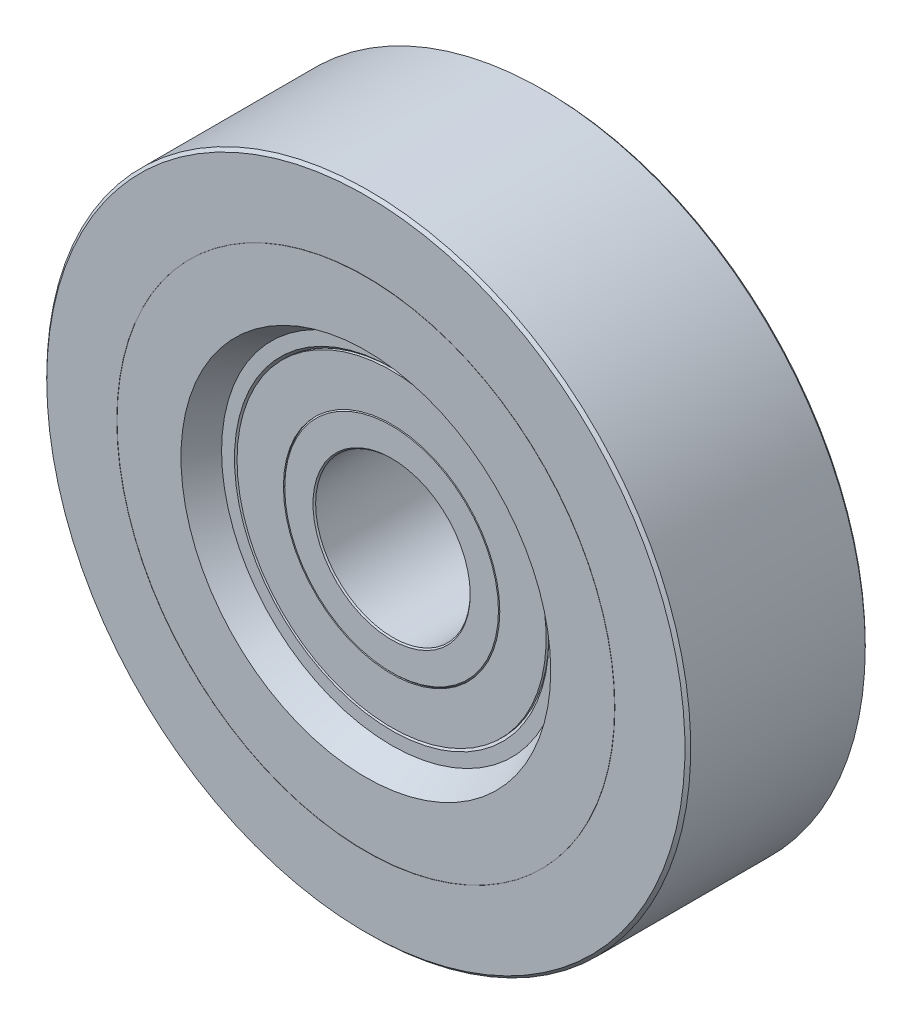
ISO-10303-21;
HEADER;
FILE_DESCRIPTION(('STEP AP214'),'2;1');
FILE_NAME('part.step','',(''),(''),'','','');
FILE_SCHEMA(('AUTOMOTIVE_DESIGN { 1 0 10303 214 1 1 1 1 }'));
ENDSEC;
DATA;
#1=APPLICATION_CONTEXT('core data for automotive mechanical design processes');
#2=APPLICATION_PROTOCOL_DEFINITION('international standard','automotive_design',2000,#1);
#3=PRODUCT_CONTEXT('',#1,'mechanical');
#4=PRODUCT('Part','Part','',(#3));
#5=PRODUCT_RELATED_PRODUCT_CATEGORY('part','',(#4));
#6=PRODUCT_DEFINITION_FORMATION('','',#4);
#7=PRODUCT_DEFINITION_CONTEXT('part definition',#1,'design');
#8=PRODUCT_DEFINITION('design','',#6,#7);
#9=PRODUCT_DEFINITION_SHAPE('','',#8);
#10=(LENGTH_UNIT() NAMED_UNIT(*) SI_UNIT(.MILLI.,.METRE.));
#11=(NAMED_UNIT(*) PLANE_ANGLE_UNIT() SI_UNIT($,.RADIAN.));
#12=(NAMED_UNIT(*) SI_UNIT($,.STERADIAN.) SOLID_ANGLE_UNIT());
#13=UNCERTAINTY_MEASURE_WITH_UNIT(LENGTH_MEASURE(1.E-05),#10,'distance_accuracy_value','');
#14=(GEOMETRIC_REPRESENTATION_CONTEXT(3) GLOBAL_UNCERTAINTY_ASSIGNED_CONTEXT((#13)) GLOBAL_UNIT_ASSIGNED_CONTEXT((#10,
#11,#12)) REPRESENTATION_CONTEXT('',''));
#15=CARTESIAN_POINT('',(0.,0.,0.));
#16=DIRECTION('',(0.,0.,1.));
#17=DIRECTION('',(1.,0.,0.));
#18=AXIS2_PLACEMENT_3D('',#15,#16,#17);
#19=CARTESIAN_POINT('',(0.,0.,4.5));
#20=DIRECTION('',(0.,0.,-1.));
#21=DIRECTION('',(-1.,0.,0.));
#22=AXIS2_PLACEMENT_3D('',#19,#20,#21);
#23=CYLINDRICAL_SURFACE('',#22,12.);
#24=CARTESIAN_POINT('',(0.,0.,5.));
#25=DIRECTION('',(0.,0.,-1.));
#26=DIRECTION('',(-1.,0.,0.));
#27=AXIS2_PLACEMENT_3D('',#24,#25,#26);
#28=CIRCLE('',#27,12.);
#29=CARTESIAN_POINT('',(-12.,0.,5.));
#30=VERTEX_POINT('',#29);
#31=EDGE_CURVE('E452',#30,#30,#28,.T.);
#32=ORIENTED_EDGE('',*,*,#31,.T.);
#33=EDGE_LOOP('',(#32));
#34=FACE_BOUND('',#33,.T.);
#35=CARTESIAN_POINT('',(0.,0.,4.8));
#36=DIRECTION('',(0.,0.,1.));
#37=DIRECTION('',(0.,1.,0.));
#38=AXIS2_PLACEMENT_3D('',#35,#36,#37);
#39=CIRCLE('',#38,12.);
#40=CARTESIAN_POINT('',(0.,12.,4.8));
#41=VERTEX_POINT('',#40);
#42=EDGE_CURVE('E8',#41,#41,#39,.T.);
#43=ORIENTED_EDGE('',*,*,#42,.T.);
#44=EDGE_LOOP('',(#43));
#45=FACE_BOUND('',#44,.T.);
#46=ADVANCED_FACE('F12',(#34,#45),#23,.T.);
#47=CARTESIAN_POINT('',(0.,0.,4.5));
#48=DIRECTION('',(0.,0.,-1.));
#49=DIRECTION('',(-1.,0.,0.));
#50=AXIS2_PLACEMENT_3D('',#47,#48,#49);
#51=CYLINDRICAL_SURFACE('',#50,8.4);
#52=CARTESIAN_POINT('',(0.,0.,4.89693251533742));
#53=DIRECTION('',(0.,0.,-1.));
#54=DIRECTION('',(0.,1.,0.));
#55=AXIS2_PLACEMENT_3D('',#52,#53,#54);
#56=CIRCLE('',#55,8.4);
#57=CARTESIAN_POINT('',(0.,8.4,4.89693251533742));
#58=VERTEX_POINT('',#57);
#59=EDGE_CURVE('E20',#58,#58,#56,.F.);
#60=ORIENTED_EDGE('',*,*,#59,.F.);
#61=EDGE_LOOP('',(#60));
#62=FACE_BOUND('',#61,.T.);
#63=CARTESIAN_POINT('',(0.,0.,5.));
#64=DIRECTION('',(0.,0.,-1.));
#65=DIRECTION('',(-1.,0.,0.));
#66=AXIS2_PLACEMENT_3D('',#63,#64,#65);
#67=CIRCLE('',#66,8.4);
#68=CARTESIAN_POINT('',(-8.4,0.,5.));
#69=VERTEX_POINT('',#68);
#70=EDGE_CURVE('E25',#69,#69,#67,.T.);
#71=ORIENTED_EDGE('',*,*,#70,.F.);
#72=EDGE_LOOP('',(#71));
#73=FACE_BOUND('',#72,.T.);
#74=ADVANCED_FACE('F401',(#62,#73),#51,.F.);
#75=CARTESIAN_POINT('',(0.,10.2,5.));
#76=DIRECTION('',(0.,0.,1.));
#77=DIRECTION('',(1.,0.,0.));
#78=AXIS2_PLACEMENT_3D('',#75,#76,#77);
#79=PLANE('',#78);
#80=ORIENTED_EDGE('',*,*,#31,.F.);
#81=EDGE_LOOP('',(#80));
#82=FACE_BOUND('',#81,.T.);
#83=ORIENTED_EDGE('',*,*,#70,.T.);
#84=EDGE_LOOP('',(#83));
#85=FACE_BOUND('',#84,.T.);
#86=ADVANCED_FACE('F192',(#82,#85),#79,.T.);
#87=CARTESIAN_POINT('',(0.,0.,-6.99));
#88=DIRECTION('',(0.,0.,-1.));
#89=DIRECTION('',(-1.,0.,0.));
#90=AXIS2_PLACEMENT_3D('',#87,#88,#89);
#91=CYLINDRICAL_SURFACE('',#90,19.314);
#92=CARTESIAN_POINT('',(0.,0.,-6.98));
#93=DIRECTION('',(0.,0.,-1.));
#94=DIRECTION('',(-1.,0.,0.));
#95=AXIS2_PLACEMENT_3D('',#92,#93,#94);
#96=CIRCLE('',#95,19.314);
#97=CARTESIAN_POINT('',(-19.314,0.,-6.98));
#98=VERTEX_POINT('',#97);
#99=EDGE_CURVE('E50',#98,#98,#96,.F.);
#100=ORIENTED_EDGE('',*,*,#99,.F.);
#101=EDGE_LOOP('',(#100));
#102=FACE_BOUND('',#101,.T.);
#103=CARTESIAN_POINT('',(0.,0.,-7.));
#104=DIRECTION('',(0.,0.,-1.));
#105=DIRECTION('',(-1.,0.,0.));
#106=AXIS2_PLACEMENT_3D('',#103,#104,#105);
#107=CIRCLE('',#106,19.314);
#108=CARTESIAN_POINT('',(-19.314,0.,-7.));
#109=VERTEX_POINT('',#108);
#110=EDGE_CURVE('E56',#109,#109,#107,.F.);
#111=ORIENTED_EDGE('',*,*,#110,.T.);
#112=EDGE_LOOP('',(#111));
#113=FACE_BOUND('',#112,.T.);
#114=ADVANCED_FACE('F184',(#102,#113),#91,.T.);
#115=CARTESIAN_POINT('',(0.,16.8343502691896,-7.));
#116=DIRECTION('',(0.,0.,-1.));
#117=DIRECTION('',(-1.,0.,0.));
#118=AXIS2_PLACEMENT_3D('',#115,#116,#117);
#119=PLANE('',#118);
#120=CARTESIAN_POINT('',(0.,0.,-7.));
#121=DIRECTION('',(0.,0.,-1.));
#122=DIRECTION('',(-1.,0.,0.));
#123=AXIS2_PLACEMENT_3D('',#120,#121,#122);
#124=CIRCLE('',#123,14.3547005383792);
#125=CARTESIAN_POINT('',(-14.3547005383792,0.,-7.));
#126=VERTEX_POINT('',#125);
#127=EDGE_CURVE('E62',#126,#126,#124,.F.);
#128=ORIENTED_EDGE('',*,*,#127,.T.);
#129=EDGE_LOOP('',(#128));
#130=FACE_BOUND('',#129,.T.);
#131=ORIENTED_EDGE('',*,*,#110,.F.);
#132=EDGE_LOOP('',(#131));
#133=FACE_BOUND('',#132,.T.);
#134=ADVANCED_FACE('F191',(#130,#133),#119,.T.);
#135=CARTESIAN_POINT('',(0.,0.,-7.));
#136=DIRECTION('',(0.,0.,-1.));
#137=DIRECTION('',(-1.,0.,0.));
#138=AXIS2_PLACEMENT_3D('',#135,#136,#137);
#139=CONICAL_SURFACE('',#138,14.3547005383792,0.523598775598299);
#140=ORIENTED_EDGE('',*,*,#127,.F.);
#141=EDGE_LOOP('',(#140));
#142=FACE_BOUND('',#141,.T.);
#143=CARTESIAN_POINT('',(0.,0.,-5.));
#144=DIRECTION('',(0.,0.,-1.));
#145=DIRECTION('',(-1.,0.,0.));
#146=AXIS2_PLACEMENT_3D('',#143,#144,#145);
#147=CIRCLE('',#146,13.2);
#148=CARTESIAN_POINT('',(-13.2,0.,-5.));
#149=VERTEX_POINT('',#148);
#150=EDGE_CURVE('E68',#149,#149,#147,.T.);
#151=ORIENTED_EDGE('',*,*,#150,.F.);
#152=EDGE_LOOP('',(#151));
#153=FACE_BOUND('',#152,.T.);
#154=ADVANCED_FACE('F125',(#142,#153),#139,.F.);
#155=CARTESIAN_POINT('',(0.,12.7,-5.));
#156=DIRECTION('',(0.,0.,-1.));
#157=DIRECTION('',(-1.,0.,0.));
#158=AXIS2_PLACEMENT_3D('',#155,#156,#157);
#159=PLANE('',#158);
#160=CARTESIAN_POINT('',(0.,0.,-5.));
#161=DIRECTION('',(0.,0.,-1.));
#162=DIRECTION('',(-1.,0.,0.));
#163=AXIS2_PLACEMENT_3D('',#160,#161,#162);
#164=CIRCLE('',#163,12.2);
#165=CARTESIAN_POINT('',(-12.2,0.,-5.));
#166=VERTEX_POINT('',#165);
#167=EDGE_CURVE('E74',#166,#166,#164,.F.);
#168=ORIENTED_EDGE('',*,*,#167,.T.);
#169=EDGE_LOOP('',(#168));
#170=FACE_BOUND('',#169,.T.);
#171=ORIENTED_EDGE('',*,*,#150,.T.);
#172=EDGE_LOOP('',(#171));
#173=FACE_BOUND('',#172,.T.);
#174=ADVANCED_FACE('F122',(#170,#173),#159,.T.);
#175=CARTESIAN_POINT('',(0.,0.,-5.));
#176=DIRECTION('',(0.,0.,-1.));
#177=DIRECTION('',(-1.,0.,0.));
#178=AXIS2_PLACEMENT_3D('',#175,#176,#177);
#179=CONICAL_SURFACE('',#178,12.2,0.785398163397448);
#180=ORIENTED_EDGE('',*,*,#167,.F.);
#181=EDGE_LOOP('',(#180));
#182=FACE_BOUND('',#181,.T.);
#183=CARTESIAN_POINT('',(0.,0.,-4.8));
#184=DIRECTION('',(0.,0.,-1.));
#185=DIRECTION('',(0.,1.,0.));
#186=AXIS2_PLACEMENT_3D('',#183,#184,#185);
#187=CIRCLE('',#186,12.);
#188=CARTESIAN_POINT('',(0.,12.,-4.8));
#189=VERTEX_POINT('',#188);
#190=EDGE_CURVE('E29',#189,#189,#187,.T.);
#191=ORIENTED_EDGE('',*,*,#190,.F.);
#192=EDGE_LOOP('',(#191));
#193=FACE_BOUND('',#192,.T.);
#194=ADVANCED_FACE('F110',(#182,#193),#179,.F.);
#195=CARTESIAN_POINT('',(0.,0.,-4.5));
#196=DIRECTION('',(0.,0.,-1.));
#197=DIRECTION('',(-1.,0.,0.));
#198=AXIS2_PLACEMENT_3D('',#195,#196,#197);
#199=CYLINDRICAL_SURFACE('',#198,12.);
#200=ORIENTED_EDGE('',*,*,#190,.T.);
#201=EDGE_LOOP('',(#200));
#202=FACE_BOUND('',#201,.T.);
#203=CARTESIAN_POINT('',(0.,0.,-5.));
#204=DIRECTION('',(0.,0.,-1.));
#205=DIRECTION('',(-1.,0.,0.));
#206=AXIS2_PLACEMENT_3D('',#203,#204,#205);
#207=CIRCLE('',#206,12.);
#208=CARTESIAN_POINT('',(-12.,0.,-5.));
#209=VERTEX_POINT('',#208);
#210=EDGE_CURVE('E16',#209,#209,#207,.T.);
#211=ORIENTED_EDGE('',*,*,#210,.F.);
#212=EDGE_LOOP('',(#211));
#213=FACE_BOUND('',#212,.T.);
#214=ADVANCED_FACE('F14',(#202,#213),#199,.T.);
#215=CARTESIAN_POINT('',(0.,10.2,-5.));
#216=DIRECTION('',(0.,0.,-1.));
#217=DIRECTION('',(-1.,0.,0.));
#218=AXIS2_PLACEMENT_3D('',#215,#216,#217);
#219=PLANE('',#218);
#220=CARTESIAN_POINT('',(0.,0.,-5.));
#221=DIRECTION('',(0.,0.,-1.));
#222=DIRECTION('',(-1.,0.,0.));
#223=AXIS2_PLACEMENT_3D('',#220,#221,#222);
#224=CIRCLE('',#223,8.4);
#225=CARTESIAN_POINT('',(-8.4,0.,-5.));
#226=VERTEX_POINT('',#225);
#227=EDGE_CURVE('E90',#226,#226,#224,.F.);
#228=ORIENTED_EDGE('',*,*,#227,.T.);
#229=EDGE_LOOP('',(#228));
#230=FACE_BOUND('',#229,.T.);
#231=ORIENTED_EDGE('',*,*,#210,.T.);
#232=EDGE_LOOP('',(#231));
#233=FACE_BOUND('',#232,.T.);
#234=ADVANCED_FACE('F107',(#230,#233),#219,.T.);
#235=CARTESIAN_POINT('',(0.,0.,-4.5));
#236=DIRECTION('',(0.,0.,-1.));
#237=DIRECTION('',(-1.,0.,0.));
#238=AXIS2_PLACEMENT_3D('',#235,#236,#237);
#239=CYLINDRICAL_SURFACE('',#238,8.4);
#240=ORIENTED_EDGE('',*,*,#227,.F.);
#241=EDGE_LOOP('',(#240));
#242=FACE_BOUND('',#241,.T.);
#243=CARTESIAN_POINT('',(0.,0.,-4.89693251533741));
#244=DIRECTION('',(0.,0.,1.));
#245=DIRECTION('',(0.,1.,0.));
#246=AXIS2_PLACEMENT_3D('',#243,#244,#245);
#247=CIRCLE('',#246,8.4);
#248=CARTESIAN_POINT('',(0.,8.4,-4.89693251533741));
#249=VERTEX_POINT('',#248);
#250=EDGE_CURVE('E87',#249,#249,#247,.F.);
#251=ORIENTED_EDGE('',*,*,#250,.F.);
#252=EDGE_LOOP('',(#251));
#253=FACE_BOUND('',#252,.T.);
#254=ADVANCED_FACE('F119',(#242,#253),#239,.F.);
#255=CARTESIAN_POINT('',(0.,0.,-4.89693251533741));
#256=DIRECTION('',(0.,0.,1.));
#257=DIRECTION('',(1.,0.,0.));
#258=AXIS2_PLACEMENT_3D('',#255,#256,#257);
#259=CONICAL_SURFACE('',#258,8.4,0.785398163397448);
#260=ORIENTED_EDGE('',*,*,#250,.T.);
#261=EDGE_LOOP('',(#260));
#262=FACE_BOUND('',#261,.T.);
#263=CARTESIAN_POINT('',(0.,0.,-5.));
#264=DIRECTION('',(0.,0.,1.));
#265=DIRECTION('',(1.,0.,0.));
#266=AXIS2_PLACEMENT_3D('',#263,#264,#265);
#267=CIRCLE('',#266,8.29693251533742);
#268=CARTESIAN_POINT('',(8.29693251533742,0.,-5.));
#269=VERTEX_POINT('',#268);
#270=EDGE_CURVE('E97',#269,#269,#267,.F.);
#271=ORIENTED_EDGE('',*,*,#270,.F.);
#272=EDGE_LOOP('',(#271));
#273=FACE_BOUND('',#272,.T.);
#274=ADVANCED_FACE('F139',(#262,#273),#259,.T.);
#275=CARTESIAN_POINT('',(0.,7.2,-5.));
#276=DIRECTION('',(0.,0.,-1.));
#277=DIRECTION('',(-1.,0.,0.));
#278=AXIS2_PLACEMENT_3D('',#275,#276,#277);
#279=PLANE('',#278);
#280=CARTESIAN_POINT('',(0.,0.,-5.00000000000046));
#281=DIRECTION('',(0.,0.,-1.));
#282=DIRECTION('',(-1.,0.,0.));
#283=AXIS2_PLACEMENT_3D('',#280,#281,#282);
#284=CIRCLE('',#283,6.10306748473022);
#285=CARTESIAN_POINT('',(-6.10306748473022,0.,-5.00000000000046));
#286=VERTEX_POINT('',#285);
#287=EDGE_CURVE('E84',#286,#286,#284,.F.);
#288=ORIENTED_EDGE('',*,*,#287,.T.);
#289=EDGE_LOOP('',(#288));
#290=FACE_BOUND('',#289,.T.);
#291=ORIENTED_EDGE('',*,*,#270,.T.);
#292=EDGE_LOOP('',(#291));
#293=FACE_BOUND('',#292,.T.);
#294=ADVANCED_FACE('F146',(#290,#293),#279,.T.);
#295=CARTESIAN_POINT('',(0.,0.,-5.00000000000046));
#296=DIRECTION('',(0.,0.,-1.));
#297=DIRECTION('',(-1.,0.,0.));
#298=AXIS2_PLACEMENT_3D('',#295,#296,#297);
#299=CONICAL_SURFACE('',#298,6.10306748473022,0.785398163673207);
#300=ORIENTED_EDGE('',*,*,#287,.F.);
#301=EDGE_LOOP('',(#300));
#302=FACE_BOUND('',#301,.T.);
#303=CARTESIAN_POINT('',(0.,0.,-4.8969325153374));
#304=DIRECTION('',(0.,0.,-1.));
#305=DIRECTION('',(-1.,0.,0.));
#306=AXIS2_PLACEMENT_3D('',#303,#304,#305);
#307=CIRCLE('',#306,6.);
#308=CARTESIAN_POINT('',(-6.,0.,-4.8969325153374));
#309=VERTEX_POINT('',#308);
#310=EDGE_CURVE('E83',#309,#309,#307,.F.);
#311=ORIENTED_EDGE('',*,*,#310,.T.);
#312=EDGE_LOOP('',(#311));
#313=FACE_BOUND('',#312,.T.);
#314=ADVANCED_FACE('F224',(#302,#313),#299,.F.);
#315=CARTESIAN_POINT('',(0.,0.,0.));
#316=DIRECTION('',(0.,0.,-1.));
#317=DIRECTION('',(-1.,0.,0.));
#318=AXIS2_PLACEMENT_3D('',#315,#316,#317);
#319=CYLINDRICAL_SURFACE('',#318,6.);
#320=ORIENTED_EDGE('',*,*,#310,.F.);
#321=EDGE_LOOP('',(#320));
#322=FACE_BOUND('',#321,.T.);
#323=CARTESIAN_POINT('',(0.,0.,4.89693251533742));
#324=DIRECTION('',(0.,0.,-1.));
#325=DIRECTION('',(-1.,0.,0.));
#326=AXIS2_PLACEMENT_3D('',#323,#324,#325);
#327=CIRCLE('',#326,6.);
#328=CARTESIAN_POINT('',(-6.,0.,4.89693251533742));
#329=VERTEX_POINT('',#328);
#330=EDGE_CURVE('E80',#329,#329,#327,.T.);
#331=ORIENTED_EDGE('',*,*,#330,.F.);
#332=EDGE_LOOP('',(#331));
#333=FACE_BOUND('',#332,.T.);
#334=ADVANCED_FACE('F140',(#322,#333),#319,.F.);
#335=CARTESIAN_POINT('',(0.,0.,4.99999999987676));
#336=DIRECTION('',(0.,0.,1.));
#337=DIRECTION('',(1.,0.,0.));
#338=AXIS2_PLACEMENT_3D('',#335,#336,#337);
#339=CONICAL_SURFACE('',#338,6.10306748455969,0.785398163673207);
#340=ORIENTED_EDGE('',*,*,#330,.T.);
#341=EDGE_LOOP('',(#340));
#342=FACE_BOUND('',#341,.T.);
#343=CARTESIAN_POINT('',(0.,0.,4.9999999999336));
#344=DIRECTION('',(0.,0.,1.));
#345=DIRECTION('',(1.,0.,0.));
#346=AXIS2_PLACEMENT_3D('',#343,#344,#345);
#347=CIRCLE('',#346,6.10306748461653);
#348=CARTESIAN_POINT('',(6.10306748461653,0.,4.9999999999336));
#349=VERTEX_POINT('',#348);
#350=EDGE_CURVE('E94',#349,#349,#347,.F.);
#351=ORIENTED_EDGE('',*,*,#350,.F.);
#352=EDGE_LOOP('',(#351));
#353=FACE_BOUND('',#352,.T.);
#354=ADVANCED_FACE('F128',(#342,#353),#339,.F.);
#355=CARTESIAN_POINT('',(0.,7.2,5.));
#356=DIRECTION('',(0.,0.,1.));
#357=DIRECTION('',(1.,0.,0.));
#358=AXIS2_PLACEMENT_3D('',#355,#356,#357);
#359=PLANE('',#358);
#360=CARTESIAN_POINT('',(0.,0.,5.));
#361=DIRECTION('',(0.,0.,-1.));
#362=DIRECTION('',(-1.,0.,0.));
#363=AXIS2_PLACEMENT_3D('',#360,#361,#362);
#364=CIRCLE('',#363,8.29693251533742);
#365=CARTESIAN_POINT('',(-8.29693251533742,0.,5.));
#366=VERTEX_POINT('',#365);
#367=EDGE_CURVE('E89',#366,#366,#364,.F.);
#368=ORIENTED_EDGE('',*,*,#367,.T.);
#369=EDGE_LOOP('',(#368));
#370=FACE_BOUND('',#369,.T.);
#371=ORIENTED_EDGE('',*,*,#350,.T.);
#372=EDGE_LOOP('',(#371));
#373=FACE_BOUND('',#372,.T.);
#374=ADVANCED_FACE('F112',(#370,#373),#359,.T.);
#375=CARTESIAN_POINT('',(0.,0.,4.89693251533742));
#376=DIRECTION('',(0.,0.,-1.));
#377=DIRECTION('',(-1.,0.,0.));
#378=AXIS2_PLACEMENT_3D('',#375,#376,#377);
#379=CONICAL_SURFACE('',#378,8.4,0.785398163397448);
#380=ORIENTED_EDGE('',*,*,#367,.F.);
#381=EDGE_LOOP('',(#380));
#382=FACE_BOUND('',#381,.T.);
#383=ORIENTED_EDGE('',*,*,#59,.T.);
#384=EDGE_LOOP('',(#383));
#385=FACE_BOUND('',#384,.T.);
#386=ADVANCED_FACE('F121',(#382,#385),#379,.T.);
#387=CARTESIAN_POINT('',(0.,19.324,-6.98));
#388=DIRECTION('',(0.,0.,-1.));
#389=DIRECTION('',(-1.,0.,0.));
#390=AXIS2_PLACEMENT_3D('',#387,#388,#389);
#391=PLANE('',#390);
#392=ORIENTED_EDGE('',*,*,#99,.T.);
#393=EDGE_LOOP('',(#392));
#394=FACE_BOUND('',#393,.T.);
#395=CARTESIAN_POINT('',(0.,0.,-6.98));
#396=DIRECTION('',(0.,0.,-1.));
#397=DIRECTION('',(-1.,0.,0.));
#398=AXIS2_PLACEMENT_3D('',#395,#396,#397);
#399=CIRCLE('',#398,19.334);
#400=CARTESIAN_POINT('',(-19.334,0.,-6.98));
#401=VERTEX_POINT('',#400);
#402=EDGE_CURVE('E44',#401,#401,#399,.T.);
#403=ORIENTED_EDGE('',*,*,#402,.T.);
#404=EDGE_LOOP('',(#403));
#405=FACE_BOUND('',#404,.T.);
#406=ADVANCED_FACE('F136',(#394,#405),#391,.T.);
#407=CARTESIAN_POINT('',(0.,0.,-6.99));
#408=DIRECTION('',(0.,0.,-1.));
#409=DIRECTION('',(-1.,0.,0.));
#410=AXIS2_PLACEMENT_3D('',#407,#408,#409);
#411=CYLINDRICAL_SURFACE('',#410,19.334);
#412=CARTESIAN_POINT('',(0.,0.,-7.));
#413=DIRECTION('',(0.,0.,-1.));
#414=DIRECTION('',(-1.,0.,0.));
#415=AXIS2_PLACEMENT_3D('',#412,#413,#414);
#416=CIRCLE('',#415,19.334);
#417=CARTESIAN_POINT('',(-19.334,0.,-7.));
#418=VERTEX_POINT('',#417);
#419=EDGE_CURVE('E38',#418,#418,#416,.F.);
#420=ORIENTED_EDGE('',*,*,#419,.F.);
#421=EDGE_LOOP('',(#420));
#422=FACE_BOUND('',#421,.T.);
#423=ORIENTED_EDGE('',*,*,#402,.F.);
#424=EDGE_LOOP('',(#423));
#425=FACE_BOUND('',#424,.T.);
#426=ADVANCED_FACE('F177',(#422,#425),#411,.F.);
#427=CARTESIAN_POINT('',(0.,22.0543873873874,-7.));
#428=DIRECTION('',(0.,0.,-1.));
#429=DIRECTION('',(-1.,0.,0.));
#430=AXIS2_PLACEMENT_3D('',#427,#428,#429);
#431=PLANE('',#430);
#432=ORIENTED_EDGE('',*,*,#419,.T.);
#433=EDGE_LOOP('',(#432));
#434=FACE_BOUND('',#433,.T.);
#435=CARTESIAN_POINT('',(0.,0.,-7.));
#436=DIRECTION('',(0.,0.,1.));
#437=DIRECTION('',(1.,0.,0.));
#438=AXIS2_PLACEMENT_3D('',#435,#436,#437);
#439=CIRCLE('',#438,24.7747747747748);
#440=CARTESIAN_POINT('',(24.7747747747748,0.,-7.));
#441=VERTEX_POINT('',#440);
#442=EDGE_CURVE('E31',#441,#441,#439,.T.);
#443=ORIENTED_EDGE('',*,*,#442,.F.);
#444=EDGE_LOOP('',(#443));
#445=FACE_BOUND('',#444,.T.);
#446=ADVANCED_FACE('F176',(#434,#445),#431,.T.);
#447=CARTESIAN_POINT('',(0.,0.,-6.7747747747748));
#448=DIRECTION('',(0.,0.,1.));
#449=DIRECTION('',(1.,0.,0.));
#450=AXIS2_PLACEMENT_3D('',#447,#448,#449);
#451=CONICAL_SURFACE('',#450,25.,0.785398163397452);
#452=ORIENTED_EDGE('',*,*,#442,.T.);
#453=EDGE_LOOP('',(#452));
#454=FACE_BOUND('',#453,.T.);
#455=CARTESIAN_POINT('',(0.,0.,-6.7747747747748));
#456=DIRECTION('',(0.,0.,-1.));
#457=DIRECTION('',(-1.,0.,0.));
#458=AXIS2_PLACEMENT_3D('',#455,#456,#457);
#459=CIRCLE('',#458,25.);
#460=CARTESIAN_POINT('',(-25.,0.,-6.7747747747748));
#461=VERTEX_POINT('',#460);
#462=EDGE_CURVE('E450',#461,#461,#459,.F.);
#463=ORIENTED_EDGE('',*,*,#462,.F.);
#464=EDGE_LOOP('',(#463));
#465=FACE_BOUND('',#464,.T.);
#466=ADVANCED_FACE('F424',(#454,#465),#451,.T.);
#467=CARTESIAN_POINT('',(0.,0.,0.));
#468=DIRECTION('',(0.,0.,-1.));
#469=DIRECTION('',(-1.,0.,0.));
#470=AXIS2_PLACEMENT_3D('',#467,#468,#469);
#471=CYLINDRICAL_SURFACE('',#470,25.);
#472=CARTESIAN_POINT('',(0.,0.,6.77477477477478));
#473=DIRECTION('',(0.,0.,-1.));
#474=DIRECTION('',(-1.,0.,0.));
#475=AXIS2_PLACEMENT_3D('',#472,#473,#474);
#476=CIRCLE('',#475,25.);
#477=CARTESIAN_POINT('',(-25.,0.,6.77477477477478));
#478=VERTEX_POINT('',#477);
#479=EDGE_CURVE('E34',#478,#478,#476,.T.);
#480=ORIENTED_EDGE('',*,*,#479,.T.);
#481=EDGE_LOOP('',(#480));
#482=FACE_BOUND('',#481,.T.);
#483=ORIENTED_EDGE('',*,*,#462,.T.);
#484=EDGE_LOOP('',(#483));
#485=FACE_BOUND('',#484,.T.);
#486=ADVANCED_FACE('F169',(#482,#485),#471,.T.);
#487=CARTESIAN_POINT('',(0.,0.,6.77477477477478));
#488=DIRECTION('',(0.,0.,-1.));
#489=DIRECTION('',(-1.,0.,0.));
#490=AXIS2_PLACEMENT_3D('',#487,#488,#489);
#491=CONICAL_SURFACE('',#490,25.,0.785398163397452);
#492=CARTESIAN_POINT('',(0.,0.,7.));
#493=DIRECTION('',(0.,0.,-1.));
#494=DIRECTION('',(-1.,0.,0.));
#495=AXIS2_PLACEMENT_3D('',#492,#493,#494);
#496=CIRCLE('',#495,24.7747747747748);
#497=CARTESIAN_POINT('',(-24.7747747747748,0.,7.));
#498=VERTEX_POINT('',#497);
#499=EDGE_CURVE('E35',#498,#498,#496,.T.);
#500=ORIENTED_EDGE('',*,*,#499,.T.);
#501=EDGE_LOOP('',(#500));
#502=FACE_BOUND('',#501,.T.);
#503=ORIENTED_EDGE('',*,*,#479,.F.);
#504=EDGE_LOOP('',(#503));
#505=FACE_BOUND('',#504,.T.);
#506=ADVANCED_FACE('F158',(#502,#505),#491,.T.);
#507=CARTESIAN_POINT('',(0.,22.0543873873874,7.));
#508=DIRECTION('',(0.,0.,1.));
#509=DIRECTION('',(1.,0.,0.));
#510=AXIS2_PLACEMENT_3D('',#507,#508,#509);
#511=PLANE('',#510);
#512=ORIENTED_EDGE('',*,*,#499,.F.);
#513=EDGE_LOOP('',(#512));
#514=FACE_BOUND('',#513,.T.);
#515=CARTESIAN_POINT('',(0.,0.,7.));
#516=DIRECTION('',(0.,0.,-1.));
#517=DIRECTION('',(-1.,0.,0.));
#518=AXIS2_PLACEMENT_3D('',#515,#516,#517);
#519=CIRCLE('',#518,19.334);
#520=CARTESIAN_POINT('',(-19.334,0.,7.));
#521=VERTEX_POINT('',#520);
#522=EDGE_CURVE('E41',#521,#521,#519,.T.);
#523=ORIENTED_EDGE('',*,*,#522,.T.);
#524=EDGE_LOOP('',(#523));
#525=FACE_BOUND('',#524,.T.);
#526=ADVANCED_FACE('F151',(#514,#525),#511,.T.);
#527=CARTESIAN_POINT('',(0.,0.,6.99));
#528=DIRECTION('',(0.,0.,-1.));
#529=DIRECTION('',(-1.,0.,0.));
#530=AXIS2_PLACEMENT_3D('',#527,#528,#529);
#531=CYLINDRICAL_SURFACE('',#530,19.334);
#532=CARTESIAN_POINT('',(0.,0.,6.98));
#533=DIRECTION('',(0.,0.,-1.));
#534=DIRECTION('',(-1.,0.,0.));
#535=AXIS2_PLACEMENT_3D('',#532,#533,#534);
#536=CIRCLE('',#535,19.334);
#537=CARTESIAN_POINT('',(-19.334,0.,6.98));
#538=VERTEX_POINT('',#537);
#539=EDGE_CURVE('E47',#538,#538,#536,.F.);
#540=ORIENTED_EDGE('',*,*,#539,.F.);
#541=EDGE_LOOP('',(#540));
#542=FACE_BOUND('',#541,.T.);
#543=ORIENTED_EDGE('',*,*,#522,.F.);
#544=EDGE_LOOP('',(#543));
#545=FACE_BOUND('',#544,.T.);
#546=ADVANCED_FACE('F157',(#542,#545),#531,.F.);
#547=CARTESIAN_POINT('',(0.,19.324,6.98));
#548=DIRECTION('',(0.,0.,1.));
#549=DIRECTION('',(1.,0.,0.));
#550=AXIS2_PLACEMENT_3D('',#547,#548,#549);
#551=PLANE('',#550);
#552=ORIENTED_EDGE('',*,*,#539,.T.);
#553=EDGE_LOOP('',(#552));
#554=FACE_BOUND('',#553,.T.);
#555=CARTESIAN_POINT('',(0.,0.,6.98));
#556=DIRECTION('',(0.,0.,-1.));
#557=DIRECTION('',(-1.,0.,0.));
#558=AXIS2_PLACEMENT_3D('',#555,#556,#557);
#559=CIRCLE('',#558,19.314);
#560=CARTESIAN_POINT('',(-19.314,0.,6.98));
#561=VERTEX_POINT('',#560);
#562=EDGE_CURVE('E53',#561,#561,#559,.T.);
#563=ORIENTED_EDGE('',*,*,#562,.T.);
#564=EDGE_LOOP('',(#563));
#565=FACE_BOUND('',#564,.T.);
#566=ADVANCED_FACE('F166',(#554,#565),#551,.T.);
#567=CARTESIAN_POINT('',(0.,0.,6.99));
#568=DIRECTION('',(0.,0.,-1.));
#569=DIRECTION('',(-1.,0.,0.));
#570=AXIS2_PLACEMENT_3D('',#567,#568,#569);
#571=CYLINDRICAL_SURFACE('',#570,19.314);
#572=CARTESIAN_POINT('',(0.,0.,7.));
#573=DIRECTION('',(0.,0.,-1.));
#574=DIRECTION('',(-1.,0.,0.));
#575=AXIS2_PLACEMENT_3D('',#572,#573,#574);
#576=CIRCLE('',#575,19.314);
#577=CARTESIAN_POINT('',(-19.314,0.,7.));
#578=VERTEX_POINT('',#577);
#579=EDGE_CURVE('E59',#578,#578,#576,.T.);
#580=ORIENTED_EDGE('',*,*,#579,.T.);
#581=EDGE_LOOP('',(#580));
#582=FACE_BOUND('',#581,.T.);
#583=ORIENTED_EDGE('',*,*,#562,.F.);
#584=EDGE_LOOP('',(#583));
#585=FACE_BOUND('',#584,.T.);
#586=ADVANCED_FACE('F187',(#582,#585),#571,.T.);
#587=CARTESIAN_POINT('',(0.,16.8343502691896,7.));
#588=DIRECTION('',(0.,0.,1.));
#589=DIRECTION('',(1.,0.,0.));
#590=AXIS2_PLACEMENT_3D('',#587,#588,#589);
#591=PLANE('',#590);
#592=ORIENTED_EDGE('',*,*,#579,.F.);
#593=EDGE_LOOP('',(#592));
#594=FACE_BOUND('',#593,.T.);
#595=CARTESIAN_POINT('',(0.,0.,7.));
#596=DIRECTION('',(0.,0.,1.));
#597=DIRECTION('',(1.,0.,0.));
#598=AXIS2_PLACEMENT_3D('',#595,#596,#597);
#599=CIRCLE('',#598,14.3547005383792);
#600=CARTESIAN_POINT('',(14.3547005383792,0.,7.));
#601=VERTEX_POINT('',#600);
#602=EDGE_CURVE('E65',#601,#601,#599,.F.);
#603=ORIENTED_EDGE('',*,*,#602,.T.);
#604=EDGE_LOOP('',(#603));
#605=FACE_BOUND('',#604,.T.);
#606=ADVANCED_FACE('F196',(#594,#605),#591,.T.);
#607=CARTESIAN_POINT('',(0.,0.,7.));
#608=DIRECTION('',(0.,0.,1.));
#609=DIRECTION('',(1.,0.,0.));
#610=AXIS2_PLACEMENT_3D('',#607,#608,#609);
#611=CONICAL_SURFACE('',#610,14.3547005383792,0.523598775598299);
#612=CARTESIAN_POINT('',(0.,0.,5.));
#613=DIRECTION('',(0.,0.,1.));
#614=DIRECTION('',(1.,0.,0.));
#615=AXIS2_PLACEMENT_3D('',#612,#613,#614);
#616=CIRCLE('',#615,13.2);
#617=CARTESIAN_POINT('',(13.2,0.,5.));
#618=VERTEX_POINT('',#617);
#619=EDGE_CURVE('E71',#618,#618,#616,.T.);
#620=ORIENTED_EDGE('',*,*,#619,.F.);
#621=EDGE_LOOP('',(#620));
#622=FACE_BOUND('',#621,.T.);
#623=ORIENTED_EDGE('',*,*,#602,.F.);
#624=EDGE_LOOP('',(#623));
#625=FACE_BOUND('',#624,.T.);
#626=ADVANCED_FACE('F203',(#622,#625),#611,.F.);
#627=CARTESIAN_POINT('',(0.,12.7,5.));
#628=DIRECTION('',(0.,0.,1.));
#629=DIRECTION('',(1.,0.,0.));
#630=AXIS2_PLACEMENT_3D('',#627,#628,#629);
#631=PLANE('',#630);
#632=ORIENTED_EDGE('',*,*,#619,.T.);
#633=EDGE_LOOP('',(#632));
#634=FACE_BOUND('',#633,.T.);
#635=CARTESIAN_POINT('',(0.,0.,5.));
#636=DIRECTION('',(0.,0.,1.));
#637=DIRECTION('',(1.,0.,0.));
#638=AXIS2_PLACEMENT_3D('',#635,#636,#637);
#639=CIRCLE('',#638,12.2);
#640=CARTESIAN_POINT('',(12.2,0.,5.));
#641=VERTEX_POINT('',#640);
#642=EDGE_CURVE('E77',#641,#641,#639,.F.);
#643=ORIENTED_EDGE('',*,*,#642,.T.);
#644=EDGE_LOOP('',(#643));
#645=FACE_BOUND('',#644,.T.);
#646=ADVANCED_FACE('F210',(#634,#645),#631,.T.);
#647=CARTESIAN_POINT('',(0.,0.,5.));
#648=DIRECTION('',(0.,0.,1.));
#649=DIRECTION('',(1.,0.,0.));
#650=AXIS2_PLACEMENT_3D('',#647,#648,#649);
#651=CONICAL_SURFACE('',#650,12.2,0.785398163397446);
#652=ORIENTED_EDGE('',*,*,#42,.F.);
#653=EDGE_LOOP('',(#652));
#654=FACE_BOUND('',#653,.T.);
#655=ORIENTED_EDGE('',*,*,#642,.F.);
#656=EDGE_LOOP('',(#655));
#657=FACE_BOUND('',#656,.T.);
#658=ADVANCED_FACE('F216',(#654,#657),#651,.F.);
#659=CLOSED_SHELL('',(#46,#74,#86,#114,#134,#154,#174,#194,#214,#234,#254,#274,#294,#314,#334,
#354,#374,#386,#406,#426,#446,#466,#486,#506,#526,#546,#566,#586,#606,#626,#646,#658));
#660=MANIFOLD_SOLID_BREP('B1',#659);
#661=ADVANCED_BREP_SHAPE_REPRESENTATION('',(#18,#660),#14);
#662=SHAPE_DEFINITION_REPRESENTATION(#9,#661);
ENDSEC;
END-ISO-10303-21;
